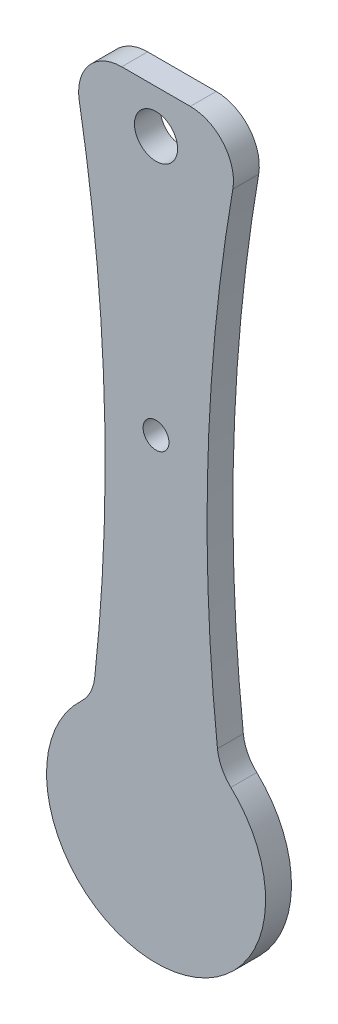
ISO-10303-21;
HEADER;
FILE_DESCRIPTION(('STEP AP214'),'2;1');
FILE_NAME('part.step','',(''),(''),'','','');
FILE_SCHEMA(('AUTOMOTIVE_DESIGN { 1 0 10303 214 1 1 1 1 }'));
ENDSEC;
DATA;
#1=APPLICATION_CONTEXT('core data for automotive mechanical design processes');
#2=APPLICATION_PROTOCOL_DEFINITION('international standard','automotive_design',2000,#1);
#3=PRODUCT_CONTEXT('',#1,'mechanical');
#4=PRODUCT('Part','Part','',(#3));
#5=PRODUCT_RELATED_PRODUCT_CATEGORY('part','',(#4));
#6=PRODUCT_DEFINITION_FORMATION('','',#4);
#7=PRODUCT_DEFINITION_CONTEXT('part definition',#1,'design');
#8=PRODUCT_DEFINITION('design','',#6,#7);
#9=PRODUCT_DEFINITION_SHAPE('','',#8);
#10=(LENGTH_UNIT() NAMED_UNIT(*) SI_UNIT(.MILLI.,.METRE.));
#11=(NAMED_UNIT(*) PLANE_ANGLE_UNIT() SI_UNIT($,.RADIAN.));
#12=(NAMED_UNIT(*) SI_UNIT($,.STERADIAN.) SOLID_ANGLE_UNIT());
#13=UNCERTAINTY_MEASURE_WITH_UNIT(LENGTH_MEASURE(1.E-05),#10,'distance_accuracy_value','');
#14=(GEOMETRIC_REPRESENTATION_CONTEXT(3) GLOBAL_UNCERTAINTY_ASSIGNED_CONTEXT((#13)) GLOBAL_UNIT_ASSIGNED_CONTEXT((#10,
#11,#12)) REPRESENTATION_CONTEXT('',''));
#15=CARTESIAN_POINT('',(0.,0.,0.));
#16=DIRECTION('',(0.,0.,1.));
#17=DIRECTION('',(1.,0.,0.));
#18=AXIS2_PLACEMENT_3D('',#15,#16,#17);
#19=CARTESIAN_POINT('',(-213.237727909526,-27.6345445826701,3.));
#20=DIRECTION('',(0.,0.,-1.));
#21=DIRECTION('',(-1.,0.,0.));
#22=AXIS2_PLACEMENT_3D('',#19,#20,#21);
#23=CYLINDRICAL_SURFACE('',#22,204.223115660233);
#24=CARTESIAN_POINT('',(-213.237727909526,-27.6345445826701,0.));
#25=DIRECTION('',(0.,0.,-1.));
#26=DIRECTION('',(-1.,0.,0.));
#27=AXIS2_PLACEMENT_3D('',#24,#25,#26);
#28=CIRCLE('',#27,204.223115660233);
#29=CARTESIAN_POINT('',(-12.0115093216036,7.2235953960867,0.));
#30=VERTEX_POINT('',#29);
#31=CARTESIAN_POINT('',(-10.225248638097,-49.8384683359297,0.));
#32=VERTEX_POINT('',#31);
#33=EDGE_CURVE('E126',#30,#32,#28,.T.);
#34=ORIENTED_EDGE('',*,*,#33,.T.);
#35=DIRECTION('',(0.,0.,-1.));
#36=VECTOR('',#35,1.);
#37=CARTESIAN_POINT('',(-10.225248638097,-49.8384683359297,3.));
#38=LINE('',#37,#36);
#39=CARTESIAN_POINT('',(-10.225248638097,-49.8384683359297,3.));
#40=VERTEX_POINT('',#39);
#41=EDGE_CURVE('E145',#32,#40,#38,.F.);
#42=ORIENTED_EDGE('',*,*,#41,.T.);
#43=CARTESIAN_POINT('',(-213.237727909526,-27.6345445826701,3.));
#44=DIRECTION('',(0.,0.,-1.));
#45=DIRECTION('',(-1.,0.,0.));
#46=AXIS2_PLACEMENT_3D('',#43,#44,#45);
#47=CIRCLE('',#46,204.223115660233);
#48=CARTESIAN_POINT('',(-12.0115093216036,7.2235953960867,3.));
#49=VERTEX_POINT('',#48);
#50=EDGE_CURVE('E124',#49,#40,#47,.T.);
#51=ORIENTED_EDGE('',*,*,#50,.F.);
#52=DIRECTION('',(0.,0.,-1.));
#53=VECTOR('',#52,1.);
#54=CARTESIAN_POINT('',(-12.0115093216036,7.2235953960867,3.));
#55=LINE('',#54,#53);
#56=EDGE_CURVE('E142',#49,#30,#55,.T.);
#57=ORIENTED_EDGE('',*,*,#56,.T.);
#58=EDGE_LOOP('',(#34,#42,#51,#57));
#59=FACE_BOUND('',#58,.T.);
#60=ADVANCED_FACE('F31',(#59),#23,.F.);
#61=CARTESIAN_POINT('',(-3.10926646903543,-62.2241794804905,3.));
#62=DIRECTION('',(0.,0.,-1.));
#63=DIRECTION('',(-1.,0.,0.));
#64=AXIS2_PLACEMENT_3D('',#61,#62,#63);
#65=CYLINDRICAL_SURFACE('',#64,12.6987923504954);
#66=CARTESIAN_POINT('',(-3.10926646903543,-62.2241794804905,0.));
#67=DIRECTION('',(0.,0.,1.));
#68=DIRECTION('',(1.,0.,0.));
#69=AXIS2_PLACEMENT_3D('',#66,#67,#68);
#70=CIRCLE('',#69,12.6987923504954);
#71=CARTESIAN_POINT('',(-11.7811546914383,-52.9474515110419,0.));
#72=VERTEX_POINT('',#71);
#73=CARTESIAN_POINT('',(5.56322594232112,-52.9480163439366,0.));
#74=VERTEX_POINT('',#73);
#75=EDGE_CURVE('E122',#72,#74,#70,.T.);
#76=ORIENTED_EDGE('',*,*,#75,.T.);
#77=DIRECTION('',(0.,0.,-1.));
#78=VECTOR('',#77,1.);
#79=CARTESIAN_POINT('',(5.56322594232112,-52.9480163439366,3.));
#80=LINE('',#79,#78);
#81=CARTESIAN_POINT('',(5.56322594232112,-52.9480163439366,3.));
#82=VERTEX_POINT('',#81);
#83=EDGE_CURVE('E101',#74,#82,#80,.F.);
#84=ORIENTED_EDGE('',*,*,#83,.T.);
#85=CARTESIAN_POINT('',(-3.10926646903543,-62.2241794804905,3.));
#86=DIRECTION('',(0.,0.,1.));
#87=DIRECTION('',(1.,0.,0.));
#88=AXIS2_PLACEMENT_3D('',#85,#86,#87);
#89=CIRCLE('',#88,12.6987923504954);
#90=CARTESIAN_POINT('',(-11.7811546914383,-52.9474515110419,3.));
#91=VERTEX_POINT('',#90);
#92=EDGE_CURVE('E132',#91,#82,#89,.T.);
#93=ORIENTED_EDGE('',*,*,#92,.F.);
#94=DIRECTION('',(0.,0.,-1.));
#95=VECTOR('',#94,1.);
#96=CARTESIAN_POINT('',(-11.7811546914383,-52.9474515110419,3.));
#97=LINE('',#96,#95);
#98=EDGE_CURVE('E115',#91,#72,#97,.T.);
#99=ORIENTED_EDGE('',*,*,#98,.T.);
#100=EDGE_LOOP('',(#76,#84,#93,#99));
#101=FACE_BOUND('',#100,.T.);
#102=ADVANCED_FACE('F171',(#101),#65,.T.);
#103=CARTESIAN_POINT('',(207.68201302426,-27.6345831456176,3.));
#104=DIRECTION('',(0.,0.,-1.));
#105=DIRECTION('',(-1.,0.,0.));
#106=AXIS2_PLACEMENT_3D('',#103,#104,#105);
#107=CYLINDRICAL_SURFACE('',#106,204.881261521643);
#108=CARTESIAN_POINT('',(207.68201302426,-27.6345831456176,3.));
#109=DIRECTION('',(0.,0.,-1.));
#110=DIRECTION('',(1.,0.,0.));
#111=AXIS2_PLACEMENT_3D('',#108,#109,#110);
#112=CIRCLE('',#111,204.881261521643);
#113=CARTESIAN_POINT('',(4.00736437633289,-49.8374843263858,3.));
#114=VERTEX_POINT('',#113);
#115=CARTESIAN_POINT('',(5.78834746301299,7.22627067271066,3.));
#116=VERTEX_POINT('',#115);
#117=EDGE_CURVE('E114',#114,#116,#112,.T.);
#118=ORIENTED_EDGE('',*,*,#117,.F.);
#119=DIRECTION('',(0.,0.,-1.));
#120=VECTOR('',#119,1.);
#121=CARTESIAN_POINT('',(4.00736437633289,-49.8374843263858,3.));
#122=LINE('',#121,#120);
#123=CARTESIAN_POINT('',(4.00736437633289,-49.8374843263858,0.));
#124=VERTEX_POINT('',#123);
#125=EDGE_CURVE('E100',#114,#124,#122,.T.);
#126=ORIENTED_EDGE('',*,*,#125,.T.);
#127=CARTESIAN_POINT('',(207.68201302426,-27.6345831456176,0.));
#128=DIRECTION('',(0.,0.,-1.));
#129=DIRECTION('',(1.,0.,0.));
#130=AXIS2_PLACEMENT_3D('',#127,#128,#129);
#131=CIRCLE('',#130,204.881261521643);
#132=CARTESIAN_POINT('',(5.78834746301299,7.22627067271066,0.));
#133=VERTEX_POINT('',#132);
#134=EDGE_CURVE('E112',#124,#133,#131,.T.);
#135=ORIENTED_EDGE('',*,*,#134,.T.);
#136=DIRECTION('',(0.,0.,-1.));
#137=VECTOR('',#136,1.);
#138=CARTESIAN_POINT('',(5.78834746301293,7.22627067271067,3.));
#139=LINE('',#138,#137);
#140=EDGE_CURVE('E116',#133,#116,#139,.F.);
#141=ORIENTED_EDGE('',*,*,#140,.T.);
#142=EDGE_LOOP('',(#118,#126,#135,#141));
#143=FACE_BOUND('',#142,.T.);
#144=ADVANCED_FACE('F111',(#143),#107,.F.);
#145=CARTESIAN_POINT('',(-13.1136443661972,13.0770281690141,3.));
#146=DIRECTION('',(0.,-1.,0.));
#147=DIRECTION('',(0.,0.,-1.));
#148=AXIS2_PLACEMENT_3D('',#145,#146,#147);
#149=PLANE('',#148);
#150=DIRECTION('',(-1.,0.,0.));
#151=VECTOR('',#150,1.);
#152=CARTESIAN_POINT('',(-13.1136443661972,13.0770281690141,3.));
#153=LINE('',#152,#151);
#154=CARTESIAN_POINT('',(0.861257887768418,13.0770281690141,3.));
#155=VERTEX_POINT('',#154);
#156=CARTESIAN_POINT('',(-7.084882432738,13.0770281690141,3.));
#157=VERTEX_POINT('',#156);
#158=EDGE_CURVE('E136',#155,#157,#153,.T.);
#159=ORIENTED_EDGE('',*,*,#158,.F.);
#160=DIRECTION('',(0.,0.,-1.));
#161=VECTOR('',#160,1.);
#162=CARTESIAN_POINT('',(0.861257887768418,13.0770281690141,3.));
#163=LINE('',#162,#161);
#164=CARTESIAN_POINT('',(0.861257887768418,13.0770281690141,0.));
#165=VERTEX_POINT('',#164);
#166=EDGE_CURVE('E148',#155,#165,#163,.T.);
#167=ORIENTED_EDGE('',*,*,#166,.T.);
#168=DIRECTION('',(-1.,0.,0.));
#169=VECTOR('',#168,1.);
#170=CARTESIAN_POINT('',(-13.1136443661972,13.0770281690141,0.));
#171=LINE('',#170,#169);
#172=CARTESIAN_POINT('',(-7.084882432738,13.0770281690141,0.));
#173=VERTEX_POINT('',#172);
#174=EDGE_CURVE('E121',#165,#173,#171,.T.);
#175=ORIENTED_EDGE('',*,*,#174,.T.);
#176=DIRECTION('',(0.,0.,-1.));
#177=VECTOR('',#176,1.);
#178=CARTESIAN_POINT('',(-7.084882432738,13.0770281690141,3.));
#179=LINE('',#178,#177);
#180=EDGE_CURVE('E45',#173,#157,#179,.F.);
#181=ORIENTED_EDGE('',*,*,#180,.T.);
#182=EDGE_LOOP('',(#159,#167,#175,#181));
#183=FACE_BOUND('',#182,.T.);
#184=ADVANCED_FACE('F177',(#183),#149,.F.);
#185=CARTESIAN_POINT('',(-213.237727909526,-27.6345445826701,3.));
#186=DIRECTION('',(0.,0.,-1.));
#187=DIRECTION('',(-1.,0.,0.));
#188=AXIS2_PLACEMENT_3D('',#185,#186,#187);
#189=PLANE('',#188);
#190=CARTESIAN_POINT('',(-3.11364436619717,8.07702816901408,3.));
#191=DIRECTION('',(0.,0.,1.));
#192=DIRECTION('',(1.,0.,0.));
#193=AXIS2_PLACEMENT_3D('',#190,#191,#192);
#194=CIRCLE('',#193,2.5);
#195=CARTESIAN_POINT('',(-0.613644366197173,8.07702816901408,3.));
#196=VERTEX_POINT('',#195);
#197=EDGE_CURVE('E261',#196,#196,#194,.T.);
#198=ORIENTED_EDGE('',*,*,#197,.F.);
#199=EDGE_LOOP('',(#198));
#200=FACE_BOUND('',#199,.T.);
#201=CARTESIAN_POINT('',(-3.11364436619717,-21.9229718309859,3.));
#202=DIRECTION('',(0.,0.,1.));
#203=DIRECTION('',(1.,0.,0.));
#204=AXIS2_PLACEMENT_3D('',#201,#202,#203);
#205=CIRCLE('',#204,1.5);
#206=CARTESIAN_POINT('',(-1.61364436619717,-21.9229718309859,3.));
#207=VERTEX_POINT('',#206);
#208=EDGE_CURVE('E263',#207,#207,#205,.T.);
#209=ORIENTED_EDGE('',*,*,#208,.F.);
#210=EDGE_LOOP('',(#209));
#211=FACE_BOUND('',#210,.T.);
#212=ORIENTED_EDGE('',*,*,#117,.T.);
#213=CARTESIAN_POINT('',(0.861257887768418,8.07702816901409,3.));
#214=DIRECTION('',(0.,0.,-1.));
#215=DIRECTION('',(-1.,0.,0.));
#216=AXIS2_PLACEMENT_3D('',#213,#214,#215);
#217=CIRCLE('',#216,5.);
#218=EDGE_CURVE('E52',#116,#155,#217,.F.);
#219=ORIENTED_EDGE('',*,*,#218,.T.);
#220=ORIENTED_EDGE('',*,*,#158,.T.);
#221=CARTESIAN_POINT('',(-7.084882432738,8.07702816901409,3.));
#222=DIRECTION('',(0.,0.,-1.));
#223=DIRECTION('',(-1.,0.,0.));
#224=AXIS2_PLACEMENT_3D('',#221,#222,#223);
#225=CIRCLE('',#224,5.);
#226=EDGE_CURVE('E154',#157,#49,#225,.F.);
#227=ORIENTED_EDGE('',*,*,#226,.T.);
#228=ORIENTED_EDGE('',*,*,#50,.T.);
#229=CARTESIAN_POINT('',(-15.1956085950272,-49.2948490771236,3.));
#230=DIRECTION('',(0.,0.,-1.));
#231=DIRECTION('',(-1.,0.,0.));
#232=AXIS2_PLACEMENT_3D('',#229,#230,#231);
#233=CIRCLE('',#232,5.);
#234=EDGE_CURVE('E11',#40,#91,#233,.T.);
#235=ORIENTED_EDGE('',*,*,#234,.T.);
#236=ORIENTED_EDGE('',*,*,#92,.T.);
#237=CARTESIAN_POINT('',(8.97791773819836,-49.2956363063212,3.));
#238=DIRECTION('',(0.,0.,-1.));
#239=DIRECTION('',(-1.,0.,0.));
#240=AXIS2_PLACEMENT_3D('',#237,#238,#239);
#241=CIRCLE('',#240,5.);
#242=EDGE_CURVE('E106',#82,#114,#241,.T.);
#243=ORIENTED_EDGE('',*,*,#242,.T.);
#244=EDGE_LOOP('',(#212,#219,#220,#227,#228,#235,#236,#243));
#245=FACE_BOUND('',#244,.T.);
#246=ADVANCED_FACE('F169',(#200,#211,#245),#189,.F.);
#247=CARTESIAN_POINT('',(-213.237727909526,-27.6345445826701,0.));
#248=DIRECTION('',(0.,0.,-1.));
#249=DIRECTION('',(-1.,0.,0.));
#250=AXIS2_PLACEMENT_3D('',#247,#248,#249);
#251=PLANE('',#250);
#252=CARTESIAN_POINT('',(-3.11364436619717,8.07702816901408,0.));
#253=DIRECTION('',(0.,0.,1.));
#254=DIRECTION('',(1.,0.,0.));
#255=AXIS2_PLACEMENT_3D('',#252,#253,#254);
#256=CIRCLE('',#255,2.5);
#257=CARTESIAN_POINT('',(-0.613644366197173,8.07702816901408,0.));
#258=VERTEX_POINT('',#257);
#259=EDGE_CURVE('E258',#258,#258,#256,.T.);
#260=ORIENTED_EDGE('',*,*,#259,.T.);
#261=EDGE_LOOP('',(#260));
#262=FACE_BOUND('',#261,.T.);
#263=CARTESIAN_POINT('',(-3.11364436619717,-21.9229718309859,0.));
#264=DIRECTION('',(0.,0.,1.));
#265=DIRECTION('',(1.,0.,0.));
#266=AXIS2_PLACEMENT_3D('',#263,#264,#265);
#267=CIRCLE('',#266,1.5);
#268=CARTESIAN_POINT('',(-1.61364436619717,-21.9229718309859,0.));
#269=VERTEX_POINT('',#268);
#270=EDGE_CURVE('E165',#269,#269,#267,.T.);
#271=ORIENTED_EDGE('',*,*,#270,.T.);
#272=EDGE_LOOP('',(#271));
#273=FACE_BOUND('',#272,.T.);
#274=ORIENTED_EDGE('',*,*,#174,.F.);
#275=CARTESIAN_POINT('',(0.861257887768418,8.07702816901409,0.));
#276=DIRECTION('',(0.,0.,-1.));
#277=DIRECTION('',(-1.,0.,0.));
#278=AXIS2_PLACEMENT_3D('',#275,#276,#277);
#279=CIRCLE('',#278,5.);
#280=EDGE_CURVE('E120',#165,#133,#279,.T.);
#281=ORIENTED_EDGE('',*,*,#280,.T.);
#282=ORIENTED_EDGE('',*,*,#134,.F.);
#283=CARTESIAN_POINT('',(8.97791773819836,-49.2956363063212,0.));
#284=DIRECTION('',(0.,0.,-1.));
#285=DIRECTION('',(-1.,0.,0.));
#286=AXIS2_PLACEMENT_3D('',#283,#284,#285);
#287=CIRCLE('',#286,5.);
#288=EDGE_CURVE('E96',#124,#74,#287,.F.);
#289=ORIENTED_EDGE('',*,*,#288,.T.);
#290=ORIENTED_EDGE('',*,*,#75,.F.);
#291=CARTESIAN_POINT('',(-15.1956085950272,-49.2948490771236,0.));
#292=DIRECTION('',(0.,0.,-1.));
#293=DIRECTION('',(-1.,0.,0.));
#294=AXIS2_PLACEMENT_3D('',#291,#292,#293);
#295=CIRCLE('',#294,5.);
#296=EDGE_CURVE('E38',#72,#32,#295,.F.);
#297=ORIENTED_EDGE('',*,*,#296,.T.);
#298=ORIENTED_EDGE('',*,*,#33,.F.);
#299=CARTESIAN_POINT('',(-7.084882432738,8.07702816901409,0.));
#300=DIRECTION('',(0.,0.,-1.));
#301=DIRECTION('',(-1.,0.,0.));
#302=AXIS2_PLACEMENT_3D('',#299,#300,#301);
#303=CIRCLE('',#302,5.);
#304=EDGE_CURVE('E151',#30,#173,#303,.T.);
#305=ORIENTED_EDGE('',*,*,#304,.T.);
#306=EDGE_LOOP('',(#274,#281,#282,#289,#290,#297,#298,#305));
#307=FACE_BOUND('',#306,.T.);
#308=ADVANCED_FACE('F119',(#262,#273,#307),#251,.T.);
#309=CARTESIAN_POINT('',(-3.11364436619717,-21.9229718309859,0.));
#310=DIRECTION('',(0.,0.,1.));
#311=DIRECTION('',(1.,0.,0.));
#312=AXIS2_PLACEMENT_3D('',#309,#310,#311);
#313=CYLINDRICAL_SURFACE('',#312,1.5);
#314=ORIENTED_EDGE('',*,*,#270,.F.);
#315=EDGE_LOOP('',(#314));
#316=FACE_BOUND('',#315,.T.);
#317=ORIENTED_EDGE('',*,*,#208,.T.);
#318=EDGE_LOOP('',(#317));
#319=FACE_BOUND('',#318,.T.);
#320=ADVANCED_FACE('F187',(#316,#319),#313,.F.);
#321=CARTESIAN_POINT('',(-3.11364436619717,8.07702816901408,0.));
#322=DIRECTION('',(0.,0.,1.));
#323=DIRECTION('',(1.,0.,0.));
#324=AXIS2_PLACEMENT_3D('',#321,#322,#323);
#325=CYLINDRICAL_SURFACE('',#324,2.5);
#326=ORIENTED_EDGE('',*,*,#259,.F.);
#327=EDGE_LOOP('',(#326));
#328=FACE_BOUND('',#327,.T.);
#329=ORIENTED_EDGE('',*,*,#197,.T.);
#330=EDGE_LOOP('',(#329));
#331=FACE_BOUND('',#330,.T.);
#332=ADVANCED_FACE('F191',(#328,#331),#325,.F.);
#333=CARTESIAN_POINT('',(8.97791773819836,-49.2956363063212,3.));
#334=DIRECTION('',(0.,0.,-1.));
#335=DIRECTION('',(-1.,0.,0.));
#336=AXIS2_PLACEMENT_3D('',#333,#334,#335);
#337=CYLINDRICAL_SURFACE('',#336,5.);
#338=ORIENTED_EDGE('',*,*,#242,.F.);
#339=ORIENTED_EDGE('',*,*,#83,.F.);
#340=ORIENTED_EDGE('',*,*,#288,.F.);
#341=ORIENTED_EDGE('',*,*,#125,.F.);
#342=EDGE_LOOP('',(#338,#339,#340,#341));
#343=FACE_BOUND('',#342,.T.);
#344=ADVANCED_FACE('F99',(#343),#337,.F.);
#345=CARTESIAN_POINT('',(-15.1956085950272,-49.2948490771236,3.));
#346=DIRECTION('',(0.,0.,-1.));
#347=DIRECTION('',(-1.,0.,0.));
#348=AXIS2_PLACEMENT_3D('',#345,#346,#347);
#349=CYLINDRICAL_SURFACE('',#348,5.);
#350=ORIENTED_EDGE('',*,*,#234,.F.);
#351=ORIENTED_EDGE('',*,*,#41,.F.);
#352=ORIENTED_EDGE('',*,*,#296,.F.);
#353=ORIENTED_EDGE('',*,*,#98,.F.);
#354=EDGE_LOOP('',(#350,#351,#352,#353));
#355=FACE_BOUND('',#354,.T.);
#356=ADVANCED_FACE('F167',(#355),#349,.F.);
#357=CARTESIAN_POINT('',(0.861257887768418,8.07702816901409,3.));
#358=DIRECTION('',(0.,0.,-1.));
#359=DIRECTION('',(-1.,0.,0.));
#360=AXIS2_PLACEMENT_3D('',#357,#358,#359);
#361=CYLINDRICAL_SURFACE('',#360,5.);
#362=ORIENTED_EDGE('',*,*,#218,.F.);
#363=ORIENTED_EDGE('',*,*,#140,.F.);
#364=ORIENTED_EDGE('',*,*,#280,.F.);
#365=ORIENTED_EDGE('',*,*,#166,.F.);
#366=EDGE_LOOP('',(#362,#363,#364,#365));
#367=FACE_BOUND('',#366,.T.);
#368=ADVANCED_FACE('F200',(#367),#361,.T.);
#369=CARTESIAN_POINT('',(-7.084882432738,8.07702816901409,3.));
#370=DIRECTION('',(0.,0.,-1.));
#371=DIRECTION('',(-1.,0.,0.));
#372=AXIS2_PLACEMENT_3D('',#369,#370,#371);
#373=CYLINDRICAL_SURFACE('',#372,5.);
#374=ORIENTED_EDGE('',*,*,#226,.F.);
#375=ORIENTED_EDGE('',*,*,#180,.F.);
#376=ORIENTED_EDGE('',*,*,#304,.F.);
#377=ORIENTED_EDGE('',*,*,#56,.F.);
#378=EDGE_LOOP('',(#374,#375,#376,#377));
#379=FACE_BOUND('',#378,.T.);
#380=ADVANCED_FACE('F203',(#379),#373,.T.);
#381=CLOSED_SHELL('',(#60,#102,#144,#184,#246,#308,#320,#332,#344,#356,#368,#380));
#382=MANIFOLD_SOLID_BREP('B2',#381);
#383=ADVANCED_BREP_SHAPE_REPRESENTATION('',(#18,#382),#14);
#384=SHAPE_DEFINITION_REPRESENTATION(#9,#383);
ENDSEC;
END-ISO-10303-21;
